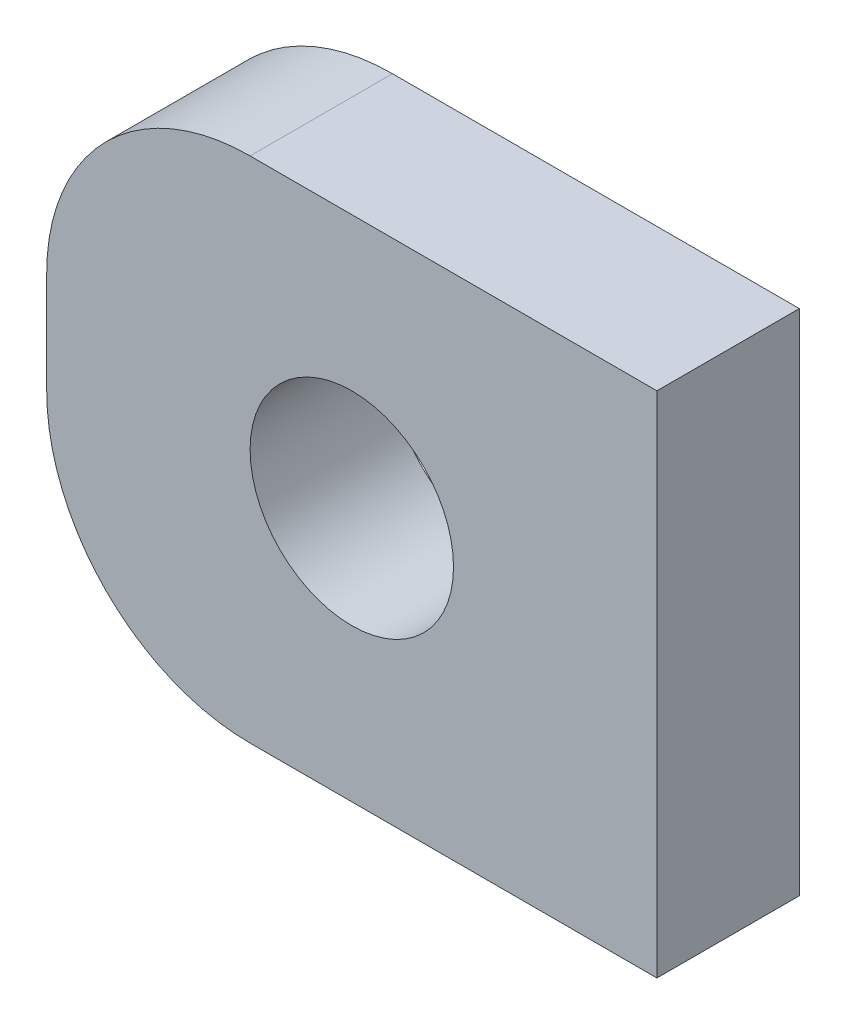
ISO-10303-21;
HEADER;
FILE_DESCRIPTION(('STEP AP214'),'2;1');
FILE_NAME('part.step','',(''),(''),'','','');
FILE_SCHEMA(('AUTOMOTIVE_DESIGN { 1 0 10303 214 1 1 1 1 }'));
ENDSEC;
DATA;
#1=APPLICATION_CONTEXT('core data for automotive mechanical design processes');
#2=APPLICATION_PROTOCOL_DEFINITION('international standard','automotive_design',2000,#1);
#3=PRODUCT_CONTEXT('',#1,'mechanical');
#4=PRODUCT('Part','Part','',(#3));
#5=PRODUCT_RELATED_PRODUCT_CATEGORY('part','',(#4));
#6=PRODUCT_DEFINITION_FORMATION('','',#4);
#7=PRODUCT_DEFINITION_CONTEXT('part definition',#1,'design');
#8=PRODUCT_DEFINITION('design','',#6,#7);
#9=PRODUCT_DEFINITION_SHAPE('','',#8);
#10=(LENGTH_UNIT() NAMED_UNIT(*) SI_UNIT(.MILLI.,.METRE.));
#11=(NAMED_UNIT(*) PLANE_ANGLE_UNIT() SI_UNIT($,.RADIAN.));
#12=(NAMED_UNIT(*) SI_UNIT($,.STERADIAN.) SOLID_ANGLE_UNIT());
#13=UNCERTAINTY_MEASURE_WITH_UNIT(LENGTH_MEASURE(1.E-05),#10,'distance_accuracy_value','');
#14=(GEOMETRIC_REPRESENTATION_CONTEXT(3) GLOBAL_UNCERTAINTY_ASSIGNED_CONTEXT((#13)) GLOBAL_UNIT_ASSIGNED_CONTEXT((#10,
#11,#12)) REPRESENTATION_CONTEXT('',''));
#15=CARTESIAN_POINT('',(0.,0.,0.));
#16=DIRECTION('',(0.,0.,1.));
#17=DIRECTION('',(1.,0.,0.));
#18=AXIS2_PLACEMENT_3D('',#15,#16,#17);
#19=CARTESIAN_POINT('',(-5.00000000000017,-37.2474487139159,-3.5));
#20=DIRECTION('',(1.,0.,0.));
#21=DIRECTION('',(0.,1.,0.));
#22=AXIS2_PLACEMENT_3D('',#19,#20,#21);
#23=PLANE('',#22);
#24=DIRECTION('',(0.,1.,0.));
#25=VECTOR('',#24,1.);
#26=CARTESIAN_POINT('',(-5.00000000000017,-37.2474487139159,3.5));
#27=LINE('',#26,#25);
#28=CARTESIAN_POINT('',(-5.00000000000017,-37.2474487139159,3.5));
#29=VERTEX_POINT('',#28);
#30=CARTESIAN_POINT('',(-5.,-12.2474487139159,3.5));
#31=VERTEX_POINT('',#30);
#32=EDGE_CURVE('E119',#29,#31,#27,.T.);
#33=ORIENTED_EDGE('',*,*,#32,.F.);
#34=DIRECTION('',(0.,0.,1.));
#35=VECTOR('',#34,1.);
#36=CARTESIAN_POINT('',(-5.00000000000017,-37.2474487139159,-3.5));
#37=LINE('',#36,#35);
#38=CARTESIAN_POINT('',(-5.00000000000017,-37.2474487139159,-3.5));
#39=VERTEX_POINT('',#38);
#40=EDGE_CURVE('E98',#39,#29,#37,.T.);
#41=ORIENTED_EDGE('',*,*,#40,.F.);
#42=DIRECTION('',(0.,1.,0.));
#43=VECTOR('',#42,1.);
#44=CARTESIAN_POINT('',(-5.00000000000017,-37.2474487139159,-3.5));
#45=LINE('',#44,#43);
#46=CARTESIAN_POINT('',(-5.,-12.2474487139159,-3.5));
#47=VERTEX_POINT('',#46);
#48=EDGE_CURVE('E103',#39,#47,#45,.T.);
#49=ORIENTED_EDGE('',*,*,#48,.T.);
#50=DIRECTION('',(0.,0.,1.));
#51=VECTOR('',#50,1.);
#52=CARTESIAN_POINT('',(-5.,-12.2474487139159,-3.5));
#53=LINE('',#52,#51);
#54=EDGE_CURVE('E86',#47,#31,#53,.T.);
#55=ORIENTED_EDGE('',*,*,#54,.T.);
#56=EDGE_LOOP('',(#33,#41,#49,#55));
#57=FACE_BOUND('',#56,.T.);
#58=ADVANCED_FACE('F33',(#57),#23,.T.);
#59=CARTESIAN_POINT('',(-5.00000000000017,-37.2474487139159,-3.5));
#60=DIRECTION('',(0.,-1.,0.));
#61=DIRECTION('',(1.,0.,0.));
#62=AXIS2_PLACEMENT_3D('',#59,#60,#61);
#63=PLANE('',#62);
#64=DIRECTION('',(1.,0.,0.));
#65=VECTOR('',#64,1.);
#66=CARTESIAN_POINT('',(-5.00000000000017,-37.2474487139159,3.5));
#67=LINE('',#66,#65);
#68=CARTESIAN_POINT('',(-25.,-37.2474487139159,3.5));
#69=VERTEX_POINT('',#68);
#70=EDGE_CURVE('E109',#69,#29,#67,.T.);
#71=ORIENTED_EDGE('',*,*,#70,.F.);
#72=DIRECTION('',(0.,0.,1.));
#73=VECTOR('',#72,1.);
#74=CARTESIAN_POINT('',(-25.,-37.2474487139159,-3.5));
#75=LINE('',#74,#73);
#76=CARTESIAN_POINT('',(-25.,-37.2474487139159,-3.5));
#77=VERTEX_POINT('',#76);
#78=EDGE_CURVE('E11',#69,#77,#75,.F.);
#79=ORIENTED_EDGE('',*,*,#78,.T.);
#80=DIRECTION('',(1.,0.,0.));
#81=VECTOR('',#80,1.);
#82=CARTESIAN_POINT('',(-5.00000000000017,-37.2474487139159,-3.5));
#83=LINE('',#82,#81);
#84=EDGE_CURVE('E99',#77,#39,#83,.T.);
#85=ORIENTED_EDGE('',*,*,#84,.T.);
#86=ORIENTED_EDGE('',*,*,#40,.T.);
#87=EDGE_LOOP('',(#71,#79,#85,#86));
#88=FACE_BOUND('',#87,.T.);
#89=ADVANCED_FACE('F145',(#88),#63,.T.);
#90=CARTESIAN_POINT('',(-35.,-37.2474487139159,-3.5));
#91=DIRECTION('',(-1.,0.,0.));
#92=DIRECTION('',(0.,-1.,0.));
#93=AXIS2_PLACEMENT_3D('',#90,#91,#92);
#94=PLANE('',#93);
#95=DIRECTION('',(0.,-1.,0.));
#96=VECTOR('',#95,1.);
#97=CARTESIAN_POINT('',(-35.,-37.2474487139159,3.5));
#98=LINE('',#97,#96);
#99=CARTESIAN_POINT('',(-35.,-22.2474487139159,3.5));
#100=VERTEX_POINT('',#99);
#101=CARTESIAN_POINT('',(-35.,-27.2474487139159,3.5));
#102=VERTEX_POINT('',#101);
#103=EDGE_CURVE('E111',#100,#102,#98,.T.);
#104=ORIENTED_EDGE('',*,*,#103,.F.);
#105=DIRECTION('',(0.,0.,1.));
#106=VECTOR('',#105,1.);
#107=CARTESIAN_POINT('',(-35.,-22.2474487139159,-3.5));
#108=LINE('',#107,#106);
#109=CARTESIAN_POINT('',(-35.,-22.2474487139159,-3.5));
#110=VERTEX_POINT('',#109);
#111=EDGE_CURVE('E134',#100,#110,#108,.F.);
#112=ORIENTED_EDGE('',*,*,#111,.T.);
#113=DIRECTION('',(0.,-1.,0.));
#114=VECTOR('',#113,1.);
#115=CARTESIAN_POINT('',(-35.,-37.2474487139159,-3.5));
#116=LINE('',#115,#114);
#117=CARTESIAN_POINT('',(-35.,-27.2474487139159,-3.5));
#118=VERTEX_POINT('',#117);
#119=EDGE_CURVE('E105',#110,#118,#116,.T.);
#120=ORIENTED_EDGE('',*,*,#119,.T.);
#121=DIRECTION('',(0.,0.,1.));
#122=VECTOR('',#121,1.);
#123=CARTESIAN_POINT('',(-35.,-27.2474487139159,-3.5));
#124=LINE('',#123,#122);
#125=EDGE_CURVE('E131',#118,#102,#124,.T.);
#126=ORIENTED_EDGE('',*,*,#125,.T.);
#127=EDGE_LOOP('',(#104,#112,#120,#126));
#128=FACE_BOUND('',#127,.T.);
#129=ADVANCED_FACE('F139',(#128),#94,.T.);
#130=CARTESIAN_POINT('',(-5.,-12.2474487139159,-3.5));
#131=DIRECTION('',(0.,1.,0.));
#132=DIRECTION('',(-1.,0.,0.));
#133=AXIS2_PLACEMENT_3D('',#130,#131,#132);
#134=PLANE('',#133);
#135=DIRECTION('',(-1.,0.,0.));
#136=VECTOR('',#135,1.);
#137=CARTESIAN_POINT('',(-5.,-12.2474487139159,-3.5));
#138=LINE('',#137,#136);
#139=CARTESIAN_POINT('',(-25.,-12.2474487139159,-3.5));
#140=VERTEX_POINT('',#139);
#141=EDGE_CURVE('E90',#47,#140,#138,.T.);
#142=ORIENTED_EDGE('',*,*,#141,.T.);
#143=DIRECTION('',(0.,0.,1.));
#144=VECTOR('',#143,1.);
#145=CARTESIAN_POINT('',(-25.,-12.2474487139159,-3.5));
#146=LINE('',#145,#144);
#147=CARTESIAN_POINT('',(-25.,-12.2474487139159,3.5));
#148=VERTEX_POINT('',#147);
#149=EDGE_CURVE('E124',#140,#148,#146,.T.);
#150=ORIENTED_EDGE('',*,*,#149,.T.);
#151=DIRECTION('',(-1.,0.,0.));
#152=VECTOR('',#151,1.);
#153=CARTESIAN_POINT('',(-5.,-12.2474487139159,3.5));
#154=LINE('',#153,#152);
#155=EDGE_CURVE('E93',#31,#148,#154,.T.);
#156=ORIENTED_EDGE('',*,*,#155,.F.);
#157=ORIENTED_EDGE('',*,*,#54,.F.);
#158=EDGE_LOOP('',(#142,#150,#156,#157));
#159=FACE_BOUND('',#158,.T.);
#160=ADVANCED_FACE('F88',(#159),#134,.T.);
#161=CARTESIAN_POINT('',(0.,0.,-3.5));
#162=DIRECTION('',(0.,0.,1.));
#163=DIRECTION('',(1.,0.,0.));
#164=AXIS2_PLACEMENT_3D('',#161,#162,#163);
#165=PLANE('',#164);
#166=CARTESIAN_POINT('',(-20.0000000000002,-24.7474487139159,-3.5));
#167=DIRECTION('',(0.,0.,-1.));
#168=DIRECTION('',(-1.,0.,0.));
#169=AXIS2_PLACEMENT_3D('',#166,#167,#168);
#170=CIRCLE('',#169,5.);
#171=CARTESIAN_POINT('',(-25.0000000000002,-24.7474487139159,-3.5));
#172=VERTEX_POINT('',#171);
#173=EDGE_CURVE('E176',#172,#172,#170,.T.);
#174=ORIENTED_EDGE('',*,*,#173,.F.);
#175=EDGE_LOOP('',(#174));
#176=FACE_BOUND('',#175,.T.);
#177=ORIENTED_EDGE('',*,*,#119,.F.);
#178=CARTESIAN_POINT('',(-25.,-22.2474487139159,-3.5));
#179=DIRECTION('',(0.,0.,1.));
#180=DIRECTION('',(1.,0.,0.));
#181=AXIS2_PLACEMENT_3D('',#178,#179,#180);
#182=CIRCLE('',#181,10.);
#183=EDGE_CURVE('E41',#110,#140,#182,.F.);
#184=ORIENTED_EDGE('',*,*,#183,.T.);
#185=ORIENTED_EDGE('',*,*,#141,.F.);
#186=ORIENTED_EDGE('',*,*,#48,.F.);
#187=ORIENTED_EDGE('',*,*,#84,.F.);
#188=CARTESIAN_POINT('',(-25.,-27.2474487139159,-3.5));
#189=DIRECTION('',(0.,0.,1.));
#190=DIRECTION('',(1.,0.,0.));
#191=AXIS2_PLACEMENT_3D('',#188,#189,#190);
#192=CIRCLE('',#191,10.);
#193=EDGE_CURVE('E53',#77,#118,#192,.F.);
#194=ORIENTED_EDGE('',*,*,#193,.T.);
#195=EDGE_LOOP('',(#177,#184,#185,#186,#187,#194));
#196=FACE_BOUND('',#195,.T.);
#197=ADVANCED_FACE('F102',(#176,#196),#165,.F.);
#198=CARTESIAN_POINT('',(0.,0.,3.5));
#199=DIRECTION('',(0.,0.,1.));
#200=DIRECTION('',(1.,0.,0.));
#201=AXIS2_PLACEMENT_3D('',#198,#199,#200);
#202=PLANE('',#201);
#203=CARTESIAN_POINT('',(-20.0000000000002,-24.7474487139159,3.5));
#204=DIRECTION('',(0.,0.,1.));
#205=DIRECTION('',(1.,0.,0.));
#206=AXIS2_PLACEMENT_3D('',#203,#204,#205);
#207=CIRCLE('',#206,5.);
#208=CARTESIAN_POINT('',(-15.0000000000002,-24.7474487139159,3.5));
#209=VERTEX_POINT('',#208);
#210=EDGE_CURVE('E114',#209,#209,#207,.F.);
#211=ORIENTED_EDGE('',*,*,#210,.T.);
#212=EDGE_LOOP('',(#211));
#213=FACE_BOUND('',#212,.T.);
#214=ORIENTED_EDGE('',*,*,#155,.T.);
#215=CARTESIAN_POINT('',(-25.,-22.2474487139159,3.5));
#216=DIRECTION('',(0.,0.,1.));
#217=DIRECTION('',(1.,0.,0.));
#218=AXIS2_PLACEMENT_3D('',#215,#216,#217);
#219=CIRCLE('',#218,10.);
#220=EDGE_CURVE('E129',#148,#100,#219,.T.);
#221=ORIENTED_EDGE('',*,*,#220,.T.);
#222=ORIENTED_EDGE('',*,*,#103,.T.);
#223=CARTESIAN_POINT('',(-25.,-27.2474487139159,3.5));
#224=DIRECTION('',(0.,0.,1.));
#225=DIRECTION('',(1.,0.,0.));
#226=AXIS2_PLACEMENT_3D('',#223,#224,#225);
#227=CIRCLE('',#226,10.);
#228=EDGE_CURVE('E127',#102,#69,#227,.T.);
#229=ORIENTED_EDGE('',*,*,#228,.T.);
#230=ORIENTED_EDGE('',*,*,#70,.T.);
#231=ORIENTED_EDGE('',*,*,#32,.T.);
#232=EDGE_LOOP('',(#214,#221,#222,#229,#230,#231));
#233=FACE_BOUND('',#232,.T.);
#234=ADVANCED_FACE('F144',(#213,#233),#202,.T.);
#235=CARTESIAN_POINT('',(-20.0000000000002,-24.7474487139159,17.642135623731));
#236=DIRECTION('',(0.,0.,-1.));
#237=DIRECTION('',(-1.,0.,0.));
#238=AXIS2_PLACEMENT_3D('',#235,#236,#237);
#239=CYLINDRICAL_SURFACE('',#238,5.);
#240=ORIENTED_EDGE('',*,*,#173,.T.);
#241=EDGE_LOOP('',(#240));
#242=FACE_BOUND('',#241,.T.);
#243=ORIENTED_EDGE('',*,*,#210,.F.);
#244=EDGE_LOOP('',(#243));
#245=FACE_BOUND('',#244,.T.);
#246=ADVANCED_FACE('F151',(#242,#245),#239,.F.);
#247=CARTESIAN_POINT('',(-25.,-22.2474487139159,-3.5));
#248=DIRECTION('',(0.,0.,1.));
#249=DIRECTION('',(1.,0.,0.));
#250=AXIS2_PLACEMENT_3D('',#247,#248,#249);
#251=CYLINDRICAL_SURFACE('',#250,10.);
#252=ORIENTED_EDGE('',*,*,#183,.F.);
#253=ORIENTED_EDGE('',*,*,#111,.F.);
#254=ORIENTED_EDGE('',*,*,#220,.F.);
#255=ORIENTED_EDGE('',*,*,#149,.F.);
#256=EDGE_LOOP('',(#252,#253,#254,#255));
#257=FACE_BOUND('',#256,.T.);
#258=ADVANCED_FACE('F142',(#257),#251,.T.);
#259=CARTESIAN_POINT('',(-25.,-27.2474487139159,-3.5));
#260=DIRECTION('',(0.,0.,1.));
#261=DIRECTION('',(1.,0.,0.));
#262=AXIS2_PLACEMENT_3D('',#259,#260,#261);
#263=CYLINDRICAL_SURFACE('',#262,10.);
#264=ORIENTED_EDGE('',*,*,#193,.F.);
#265=ORIENTED_EDGE('',*,*,#78,.F.);
#266=ORIENTED_EDGE('',*,*,#228,.F.);
#267=ORIENTED_EDGE('',*,*,#125,.F.);
#268=EDGE_LOOP('',(#264,#265,#266,#267));
#269=FACE_BOUND('',#268,.T.);
#270=ADVANCED_FACE('F35',(#269),#263,.T.);
#271=CLOSED_SHELL('',(#58,#89,#129,#160,#197,#234,#246,#258,#270));
#272=MANIFOLD_SOLID_BREP('B2',#271);
#273=ADVANCED_BREP_SHAPE_REPRESENTATION('',(#18,#272),#14);
#274=SHAPE_DEFINITION_REPRESENTATION(#9,#273);
ENDSEC;
END-ISO-10303-21;
